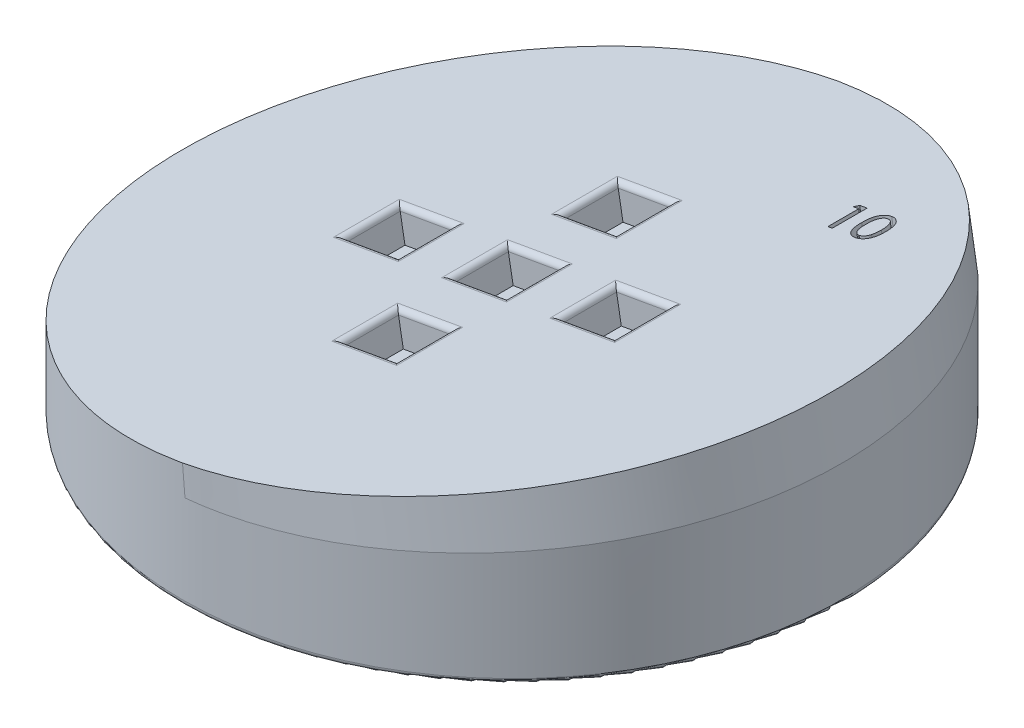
from build123d import *

# Parameters (mm, degrees)
SKETCH1_R           = 30
BOSS_EXTRUDE1_DEPTH = 50
SKETCH4_W           = 5
SKETCH4_H           = 5
CUT_EXTRUDE2_DEPTH  = 3
FILLET2_R           = 0.5
CUT_EXTRUDE10_DEPTH = 45
SKETCH15_W          = 5
SKETCH15_H          = 5
CUT_EXTRUDE11_DEPTH = 3
CUT_EXTRUDE13_DEPTH = 100
FILLET8_R           = 0.5
FILLET9_R           = 0.5
FILLET10_R          = 0.5
FILLET11_R          = 0.5
FILLET12_R          = 0.5
CUT_EXTRUDE14_DEPTH = 4


with BuildPart() as part:
    # Sketch1 → Boss-Extrude1 (new body)
    with BuildSketch(Plane(origin=(0, 0, 0), x_dir=(1, 0, 0), z_dir=(0, 1, 0))):
        with Locations(Location((0, 0, 0), (0, 0, 270))):
            Circle(SKETCH1_R)
    extrude(amount=BOSS_EXTRUDE1_DEPTH)

    # Sketch4 → Cut-Extrude2 (cut)
    with BuildSketch(Plane(origin=(0, 0, 0), x_dir=(-1, 0, 0), z_dir=(0, -1, 0))):
        Rectangle(SKETCH4_W, SKETCH4_H)
        with Locations((0, -10)):
            Rectangle(SKETCH4_W, SKETCH4_H)
        with Locations((10, 0)):
            Rectangle(SKETCH4_W, SKETCH4_H)
        with Locations((-10, 0)):
            Rectangle(SKETCH4_W, SKETCH4_H)
        with Locations((0, 10)):
            Rectangle(SKETCH4_W, SKETCH4_H)
    extrude(amount=-CUT_EXTRUDE2_DEPTH, mode=Mode.SUBTRACT)

    # Fillet2
    fillet2_edges = [part.edges().sort_by_distance(p)[0] for p in [
        (0, 0, -30),
        (-2.5, 0, 10),
        (0, 0, 7.5),
        (2.5, 0, 10),
        (0, 0, 12.5),
        (-12.5, 0, 0),
        (-10, 0, -2.5),
        (-7.5, 0, 0),
        (-10, 0, 2.5),
        (7.5, 0, 0),
        (10, 0, -2.5),
        (12.5, 0, 0),
        (10, 0, 2.5),
        (2.5, 0, -10),
        (0, 0, -7.5),
        (-2.5, 0, -10),
        (0, 0, -12.5),
        (-2.5, 0, 0),
        (0, 0, -2.5),
        (2.5, 0, 0),
        (0, 0, 2.5),
    ]]
    fillet(fillet2_edges, radius=FILLET2_R)

    # Sketch13 → Cut-Extrude10 (cut, symmetric)
    with BuildSketch(Plane.XY.offset(3.5)):
        Polygon((-30, 6), (30, 16.579618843), (30, 50), (-30, 50), align=None)
    extrude(amount=CUT_EXTRUDE10_DEPTH, both=True, mode=Mode.SUBTRACT)

    # Sketch15 → Cut-Extrude11 (cut)
    with BuildSketch(Plane(origin=(-1.930671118, 10.949380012, 0), x_dir=(0.9848077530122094, 0.17364817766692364, 0), z_dir=(-0.17364817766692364, 0.9848077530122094, 0))):
        with Locations((-8.502343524, 0)):
            Rectangle(SKETCH15_W, SKETCH15_H)
        with Locations((1.497656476, 0)):
            Rectangle(SKETCH15_W, SKETCH15_H)
        with Locations((11.497656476, 0)):
            Rectangle(SKETCH15_W, SKETCH15_H)
        with Locations((1.497656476, -10)):
            Rectangle(SKETCH15_W, SKETCH15_H)
        with Locations((1.497656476, 10)):
            Rectangle(SKETCH15_W, SKETCH15_H)
    extrude(amount=-CUT_EXTRUDE11_DEPTH, mode=Mode.SUBTRACT)

    # Sketch24 → Cut-Extrude13 (cut)
    with BuildSketch(Plane(origin=(-1.930671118, 10.949380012, 0), x_dir=(0.9848077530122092, 0.17364817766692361, 0), z_dir=(-0.17364817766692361, 0.9848077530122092, 0))):
        with BuildLine():
            ThreePointArc((1.727284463, 29.99912117), (31.497656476, 0), (1.727284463, -29.99912117))
            add(Edge.make_bspline(
                [(1.960454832, -30), (1.84386794, -30), (1.727284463, -29.99912117)],
                knots=[4.71238898, 4.71238898, 4.71238898, 4.720877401, 4.720877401, 4.720877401], degree=2, weights=[1, 0.998417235, 0.996851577]))
            add(Edge.make_bspline(
                [(32.423253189, 0), (32.423253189, -30), (1.960454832, -30)],
                knots=[3.141592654, 3.141592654, 3.141592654, 4.71238898, 4.71238898, 4.71238898], degree=2, weights=[1, 0.707106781, 1]))
            add(Edge.make_bspline(
                [(1.727284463, 29.99912117), (1.84386794, 30), (1.960454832, 30), (32.423253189, 30), (32.423253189, 0)],
                knots=[1.562307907, 1.562307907, 1.562307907, 1.570796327, 1.570796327, 3.141592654, 3.141592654, 3.141592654], degree=2, weights=[0.996851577, 0.998417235, 1, 0.707106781, 1]))
        make_face()
    extrude(amount=-CUT_EXTRUDE13_DEPTH, mode=Mode.SUBTRACT)

    # Fillet8
    fillet8_edges = [part.edges().sort_by_distance(p)[0] for p in [
        (-2.917786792, 10.775324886, -10),
        (-0.45576741, 11.20944533, -7.5),
        (2.006251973, 11.643565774, -10),
        (-0.45576741, 11.20944533, -12.5),
    ]]
    fillet(fillet8_edges, radius=FILLET8_R)

    # Fillet9
    fillet9_edges = [part.edges().sort_by_distance(p)[0] for p in [
        (6.930290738, 12.511806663, 0),
        (9.39231012, 12.945927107, 2.5),
        (11.854329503, 13.380047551, 0),
        (9.39231012, 12.945927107, -2.5),
    ]]
    fillet(fillet9_edges, radius=FILLET9_R)

    # Fillet10
    fillet10_edges = [part.edges().sort_by_distance(p)[0] for p in [
        (-12.765864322, 9.038843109, 0),
        (-10.30384494, 9.472963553, 2.5),
        (-7.841825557, 9.907083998, 0),
        (-10.30384494, 9.472963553, -2.5),
    ]]
    fillet(fillet10_edges, radius=FILLET10_R)

    # Fillet11
    fillet11_edges = [part.edges().sort_by_distance(p)[0] for p in [
        (-2.917786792, 10.775324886, 10),
        (-0.45576741, 11.20944533, 12.5),
        (2.006251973, 11.643565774, 10),
        (-0.45576741, 11.20944533, 7.5),
    ]]
    fillet(fillet11_edges, radius=FILLET11_R)

    # Fillet12
    fillet12_edges = [part.edges().sort_by_distance(p)[0] for p in [
        (-2.917786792, 10.775324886, 0),
        (-0.45576741, 11.20944533, 2.5),
        (2.006251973, 11.643565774, 0),
        (-0.45576741, 11.20944533, -2.5),
    ]]
    fillet(fillet12_edges, radius=FILLET12_R)

    # Sketch25 → Cut-Extrude14 (cut)
    # profile 1 of 2: a face of its own
    with BuildSketch(Plane(origin=(-1.930671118, 10.949380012, 0), x_dir=(0.9848077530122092, 0.17364817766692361, 0), z_dir=(-0.17364817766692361, 0.9848077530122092, 0))):
        Polygon((14.917748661, 18.888447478), (15.608463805, 18.888447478), (15.608463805, 15.713447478), (15.201412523, 15.713447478), (15.201412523, 18.522101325), (14.712950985, 18.522101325), align=None)
    # profile 2 of 2: a face of its own
    with BuildSketch(Plane(origin=(-1.930671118, 10.949380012, 0), x_dir=(0.9848077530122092, 0.17364817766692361, 0), z_dir=(-0.17364817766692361, 0.9848077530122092, 0))):
        with BuildLine():
            add(Edge.make_bspline(
                [(16.707502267, 17.299675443), (16.707805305, 17.350139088), (16.708393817, 17.448141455), (16.71473529, 17.590709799), (16.725674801, 17.724531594), (16.739726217, 17.849610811), (16.75916598, 17.966033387), (16.781409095, 18.073856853), (16.808789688, 18.173094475), (16.84077116, 18.263923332), (16.87667992, 18.347956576), (16.916161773, 18.426246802), (16.95896666, 18.499788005), (17.004805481, 18.568554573), (17.055845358, 18.631014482), (17.109089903, 18.689306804), (17.166538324, 18.742293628), (17.227664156, 18.78970968), (17.290895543, 18.832578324), (17.356980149, 18.868710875), (17.424386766, 18.90018577), (17.49397498, 18.925646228), (17.565240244, 18.94542415), (17.638437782, 18.959236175), (17.713219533, 18.968747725), (17.763897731, 18.969486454), (17.789368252, 18.969857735)],
                knots=[0, 0, 0, 0, 1.622528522, 3.151013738, 4.587225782, 5.939257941, 7.196658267, 8.381214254, 9.47772444, 10.503964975, 11.475138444, 12.414102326, 13.321377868, 14.209997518, 15.068075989, 15.912287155, 16.746865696, 17.577313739, 18.397854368, 19.200328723, 19.996378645, 20.787862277, 21.580050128, 22.371504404, 23.181529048, 24, 24, 24, 24], degree=3))
            add(Edge.make_bspline(
                [(17.789368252, 18.969857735), (17.81715381, 18.969126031), (17.871997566, 18.967681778), (17.953388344, 18.959822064), (18.032050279, 18.943942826), (18.10906265, 18.924029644), (18.183178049, 18.896807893), (18.25586461, 18.865504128), (18.324885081, 18.825854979), (18.392593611, 18.782484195), (18.456668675, 18.732469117), (18.517953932, 18.678124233), (18.574538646, 18.617594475), (18.628485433, 18.552962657), (18.677027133, 18.481697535), (18.723237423, 18.406294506), (18.764153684, 18.324875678), (18.802974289, 18.238881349), (18.836342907, 18.14602493), (18.866544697, 18.046836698), (18.891019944, 17.940080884), (18.911322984, 17.826089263), (18.926969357, 17.704669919), (18.938524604, 17.576111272), (18.944557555, 17.44029313), (18.94569849, 17.34738192), (18.946284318, 17.299675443)],
                knots=[0, 0, 0, 0, 0.875057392, 1.727207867, 2.570264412, 3.399251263, 4.229017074, 5.053828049, 5.887584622, 6.731829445, 7.583639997, 8.443960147, 9.308026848, 10.190032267, 11.091770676, 12.020167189, 12.972467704, 13.958579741, 14.989078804, 16.076606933, 17.221320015, 18.435081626, 19.720875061, 21.074561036, 22.497895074, 24, 24, 24, 24], degree=3))
            add(Edge.make_bspline(
                [(18.946284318, 17.299675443), (18.945692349, 17.252181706), (18.944539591, 17.159695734), (18.938593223, 17.024502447), (18.926738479, 16.896642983), (18.912142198, 16.775758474), (18.891668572, 16.662216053), (18.866739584, 16.555955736), (18.838783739, 16.456418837), (18.804609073, 16.364477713), (18.766767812, 16.278584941), (18.725712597, 16.197894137), (18.680496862, 16.12224629), (18.630431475, 16.052462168), (18.577902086, 15.986345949), (18.520626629, 15.926195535), (18.459648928, 15.870864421), (18.395116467, 15.821057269), (18.327767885, 15.776141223), (18.25718069, 15.738226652), (18.185134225, 15.704573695), (18.11001988, 15.679069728), (18.033360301, 15.657304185), (17.953864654, 15.643244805), (17.872270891, 15.633936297), (17.817167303, 15.632674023), (17.789368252, 15.632037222)],
                knots=[0, 0, 0, 0, 1.496607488, 2.914388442, 4.262485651, 5.541812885, 6.749953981, 7.895567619, 8.980172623, 10.005210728, 10.983286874, 11.936336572, 12.856292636, 13.757107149, 14.640766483, 15.514956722, 16.370989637, 17.232841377, 18.081413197, 18.918442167, 19.755471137, 20.583656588, 21.41504191, 22.264086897, 23.124254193, 24, 24, 24, 24], degree=3))
            add(Edge.make_bspline(
                [(17.789368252, 15.632037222), (17.763693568, 15.632473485), (17.712843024, 15.633337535), (17.637754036, 15.641811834), (17.564606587, 15.655876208), (17.493615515, 15.675588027), (17.424282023, 15.700614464), (17.356906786, 15.730930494), (17.291932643, 15.767639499), (17.228739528, 15.808885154), (17.168245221, 15.855799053), (17.111898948, 15.908823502), (17.058345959, 15.966691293), (17.008647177, 16.030026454), (16.961704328, 16.098420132), (16.919386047, 16.172516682), (16.879931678, 16.25152473), (16.843352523, 16.336052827), (16.810324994, 16.427569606), (16.783982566, 16.527865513), (16.759141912, 16.63584613), (16.740912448, 16.752603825), (16.725096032, 16.877257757), (16.715920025, 17.010617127), (16.70807842, 17.152239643), (16.707697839, 17.249629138), (16.707502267, 17.299675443)],
                knots=[0, 0, 0, 0, 0.82614074, 1.636230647, 2.42850654, 3.22151677, 4.005075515, 4.799112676, 5.596456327, 6.404618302, 7.226350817, 8.05679228, 8.892237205, 9.761873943, 10.645770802, 11.559890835, 12.505927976, 13.487073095, 14.523090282, 15.633895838, 16.822583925, 18.088023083, 19.435493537, 20.865857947, 22.389433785, 24, 24, 24, 24], degree=3))
        make_face()
        with BuildLine():
            add(Edge.make_bspline(
                [(17.114553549, 17.300947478), (17.114717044, 17.258329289), (17.115033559, 17.175823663), (17.119733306, 17.0564344), (17.126424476, 16.945264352), (17.136433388, 16.842343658), (17.149779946, 16.747519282), (17.165576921, 16.660922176), (17.183587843, 16.582386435), (17.205546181, 16.511783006), (17.229859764, 16.447452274), (17.256893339, 16.388227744), (17.284963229, 16.332767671), (17.316583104, 16.282171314), (17.350069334, 16.235747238), (17.386026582, 16.193672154), (17.423171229, 16.155023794), (17.476158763, 16.112108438), (17.544051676, 16.067240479), (17.628332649, 16.028333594), (17.713248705, 16.002651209), (17.770538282, 15.999796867), (17.798908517, 15.998383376)],
                knots=[0, 0, 0, 0, 1.564601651, 3.028951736, 4.386019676, 5.653114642, 6.824348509, 7.900668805, 8.88431448, 9.780488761, 10.613163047, 11.407444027, 12.169849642, 12.89344098, 13.595615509, 14.26934431, 14.924332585, 15.560171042, 16.769153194, 17.901006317, 18.960562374, 20, 20, 20, 20], degree=3))
            add(Edge.make_bspline(
                [(17.798908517, 15.998383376), (17.831057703, 16.000065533), (17.895156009, 16.003419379), (17.989557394, 16.027839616), (18.08007278, 16.068825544), (18.151793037, 16.115130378), (18.205980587, 16.160167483), (18.245113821, 16.198507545), (18.281183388, 16.24131158), (18.315234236, 16.287927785), (18.346023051, 16.339118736), (18.375710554, 16.393722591), (18.401559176, 16.453049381), (18.416498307, 16.494390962), (18.424113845, 16.515465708)],
                knots=[0, 0, 0, 0, 1.331887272, 2.655486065, 4.012646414, 5.436183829, 6.178803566, 6.930724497, 7.703763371, 8.496530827, 9.320959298, 10.178042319, 11.071218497, 12, 12, 12, 12], degree=3))
            add(Edge.make_bspline(
                [(18.424113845, 16.515465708), (18.433288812, 16.543154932), (18.451992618, 16.599601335), (18.475425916, 16.687484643), (18.494825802, 16.779700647), (18.511530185, 16.875758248), (18.524213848, 16.976141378), (18.532980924, 17.080753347), (18.538009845, 17.1895948), (18.538820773, 17.263417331), (18.539233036, 17.300947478)],
                knots=[0, 0, 0, 0, 0.877617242, 1.789083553, 2.735016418, 3.71249782, 4.722174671, 5.778575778, 6.870664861, 8, 8, 8, 8], degree=3))
            add(Edge.make_bspline(
                [(18.539233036, 17.300947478), (18.539134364, 17.338481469), (18.538941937, 17.411679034), (18.533222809, 17.518749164), (18.526306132, 17.620665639), (18.514373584, 17.71709376), (18.501019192, 17.80851475), (18.482701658, 17.894282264), (18.46305505, 17.975252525), (18.438510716, 18.050425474), (18.411676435, 18.120559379), (18.383373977, 18.185887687), (18.352772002, 18.246462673), (18.319055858, 18.301524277), (18.283469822, 18.351980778), (18.245881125, 18.397528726), (18.205729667, 18.437911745), (18.149596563, 18.483444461), (18.077233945, 18.530834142), (17.986750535, 18.573363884), (17.893317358, 18.598436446), (17.830213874, 18.601828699), (17.798908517, 18.603511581)],
                knots=[0, 0, 0, 0, 1.353201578, 2.638969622, 3.865559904, 5.035676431, 6.141732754, 7.195734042, 8.19695873, 9.144657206, 10.044788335, 10.904062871, 11.710933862, 12.489720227, 13.229995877, 13.935715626, 14.616825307, 15.279494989, 16.538995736, 17.725922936, 18.871840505, 20, 20, 20, 20], degree=3))
            add(Edge.make_bspline(
                [(17.798908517, 18.603511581), (17.770546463, 18.602070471), (17.713068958, 18.599149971), (17.628024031, 18.573824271), (17.54404646, 18.534608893), (17.476608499, 18.489709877), (17.424059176, 18.446840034), (17.386407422, 18.409070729), (17.351621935, 18.366757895), (17.318052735, 18.320707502), (17.287400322, 18.269778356), (17.257628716, 18.214899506), (17.231397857, 18.155164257), (17.206729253, 18.090784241), (17.185002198, 18.020051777), (17.166212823, 17.941635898), (17.149422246, 17.85513454), (17.137321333, 17.760118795), (17.127148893, 17.657041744), (17.119535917, 17.545697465), (17.115090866, 17.426068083), (17.114736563, 17.343564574), (17.114553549, 17.300947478)],
                knots=[0, 0, 0, 0, 1.039778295, 2.107176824, 3.232337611, 4.43520669, 5.071253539, 5.720927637, 6.389866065, 7.081397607, 7.811854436, 8.571243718, 9.372887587, 10.205834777, 11.102302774, 12.088086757, 13.166194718, 14.33675119, 15.604261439, 16.970055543, 18.43488556, 20, 20, 20, 20], degree=3))
        make_face(mode=Mode.SUBTRACT)
    extrude(amount=-CUT_EXTRUDE14_DEPTH, mode=Mode.SUBTRACT)


solid = part.part
